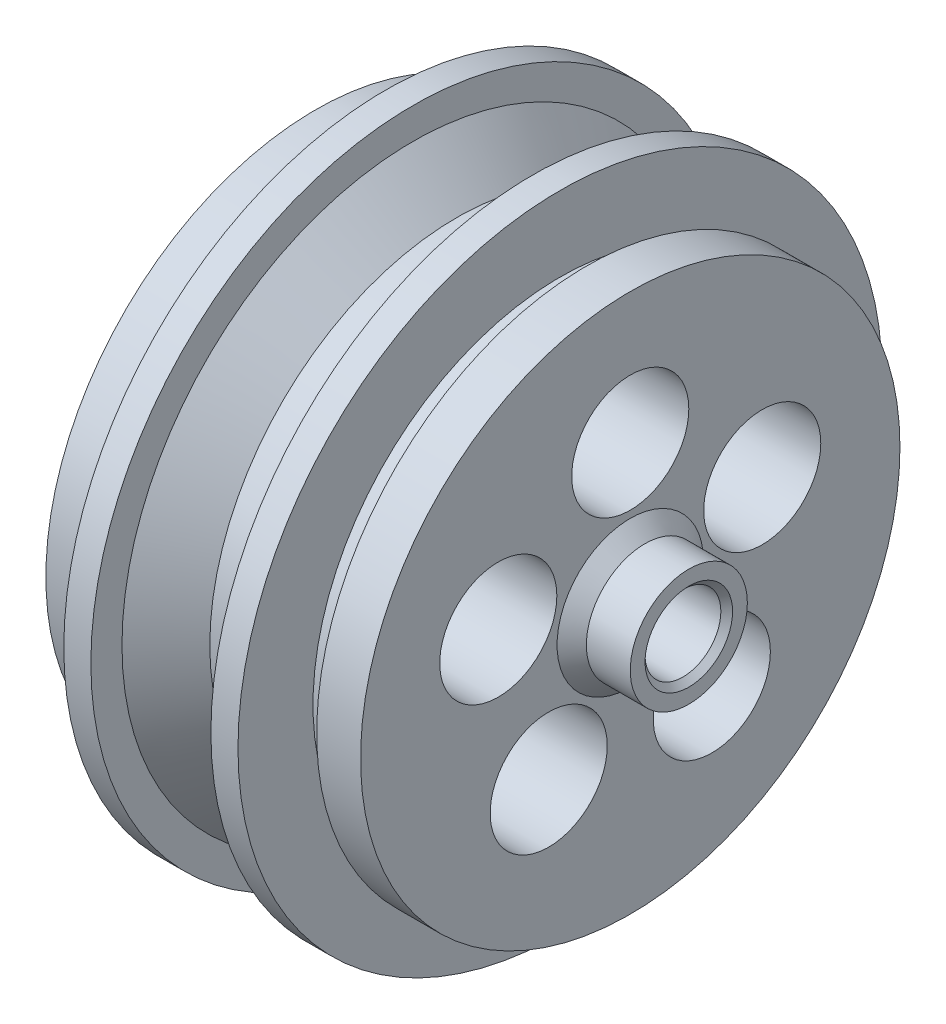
ISO-10303-21;
HEADER;
FILE_DESCRIPTION(('STEP AP214'),'2;1');
FILE_NAME('part.step','',(''),(''),'','','');
FILE_SCHEMA(('AUTOMOTIVE_DESIGN { 1 0 10303 214 1 1 1 1 }'));
ENDSEC;
DATA;
#1=APPLICATION_CONTEXT('core data for automotive mechanical design processes');
#2=APPLICATION_PROTOCOL_DEFINITION('international standard','automotive_design',2000,#1);
#3=PRODUCT_CONTEXT('',#1,'mechanical');
#4=PRODUCT('Part','Part','',(#3));
#5=PRODUCT_RELATED_PRODUCT_CATEGORY('part','',(#4));
#6=PRODUCT_DEFINITION_FORMATION('','',#4);
#7=PRODUCT_DEFINITION_CONTEXT('part definition',#1,'design');
#8=PRODUCT_DEFINITION('design','',#6,#7);
#9=PRODUCT_DEFINITION_SHAPE('','',#8);
#10=(LENGTH_UNIT() NAMED_UNIT(*) SI_UNIT(.MILLI.,.METRE.));
#11=(NAMED_UNIT(*) PLANE_ANGLE_UNIT() SI_UNIT($,.RADIAN.));
#12=(NAMED_UNIT(*) SI_UNIT($,.STERADIAN.) SOLID_ANGLE_UNIT());
#13=UNCERTAINTY_MEASURE_WITH_UNIT(LENGTH_MEASURE(1.E-05),#10,'distance_accuracy_value','');
#14=(GEOMETRIC_REPRESENTATION_CONTEXT(3) GLOBAL_UNCERTAINTY_ASSIGNED_CONTEXT((#13)) GLOBAL_UNIT_ASSIGNED_CONTEXT((#10,
#11,#12)) REPRESENTATION_CONTEXT('',''));
#15=CARTESIAN_POINT('',(0.,0.,0.));
#16=DIRECTION('',(0.,0.,1.));
#17=DIRECTION('',(1.,0.,0.));
#18=AXIS2_PLACEMENT_3D('',#15,#16,#17);
#19=CARTESIAN_POINT('',(14.85,0.,0.));
#20=DIRECTION('',(1.,0.,0.));
#21=DIRECTION('',(0.,0.,-1.));
#22=AXIS2_PLACEMENT_3D('',#19,#20,#21);
#23=PLANE('',#22);
#24=CARTESIAN_POINT('',(14.85,0.,0.));
#25=DIRECTION('',(1.,0.,0.));
#26=DIRECTION('',(0.,0.,-1.));
#27=AXIS2_PLACEMENT_3D('',#24,#25,#26);
#28=CIRCLE('',#27,5.);
#29=CARTESIAN_POINT('',(14.85,0.,-5.));
#30=VERTEX_POINT('',#29);
#31=EDGE_CURVE('E61',#30,#30,#28,.F.);
#32=ORIENTED_EDGE('',*,*,#31,.T.);
#33=EDGE_LOOP('',(#32));
#34=FACE_BOUND('',#33,.T.);
#35=CARTESIAN_POINT('',(14.85,0.,0.));
#36=DIRECTION('',(1.,0.,0.));
#37=DIRECTION('',(0.,0.,-1.));
#38=AXIS2_PLACEMENT_3D('',#35,#36,#37);
#39=CIRCLE('',#38,18.425);
#40=CARTESIAN_POINT('',(14.85,0.,-18.425));
#41=VERTEX_POINT('',#40);
#42=EDGE_CURVE('E103',#41,#41,#39,.T.);
#43=ORIENTED_EDGE('',*,*,#42,.T.);
#44=EDGE_LOOP('',(#43));
#45=FACE_BOUND('',#44,.T.);
#46=CARTESIAN_POINT('',(14.85,9.47983733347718,0.));
#47=DIRECTION('',(1.,0.,0.));
#48=DIRECTION('',(0.,0.,-1.));
#49=AXIS2_PLACEMENT_3D('',#46,#47,#48);
#50=CIRCLE('',#49,4.);
#51=CARTESIAN_POINT('',(14.85,9.47983733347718,-4.));
#52=VERTEX_POINT('',#51);
#53=EDGE_CURVE('E139',#52,#52,#50,.T.);
#54=ORIENTED_EDGE('',*,*,#53,.F.);
#55=EDGE_LOOP('',(#54));
#56=FACE_BOUND('',#55,.T.);
#57=CARTESIAN_POINT('',(14.85,2.92943083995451,-9.01586106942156));
#58=DIRECTION('',(1.,0.,0.));
#59=DIRECTION('',(0.,0.,-1.));
#60=AXIS2_PLACEMENT_3D('',#57,#58,#59);
#61=CIRCLE('',#60,4.);
#62=CARTESIAN_POINT('',(14.85,2.92943083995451,-13.0158610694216));
#63=VERTEX_POINT('',#62);
#64=EDGE_CURVE('E159',#63,#63,#61,.T.);
#65=ORIENTED_EDGE('',*,*,#64,.F.);
#66=EDGE_LOOP('',(#65));
#67=FACE_BOUND('',#66,.T.);
#68=CARTESIAN_POINT('',(14.85,-7.66934950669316,-5.57210857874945));
#69=DIRECTION('',(1.,0.,0.));
#70=DIRECTION('',(0.,0.,-1.));
#71=AXIS2_PLACEMENT_3D('',#68,#69,#70);
#72=CIRCLE('',#71,4.);
#73=CARTESIAN_POINT('',(14.85,-7.66934950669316,-9.57210857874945));
#74=VERTEX_POINT('',#73);
#75=EDGE_CURVE('E155',#74,#74,#72,.T.);
#76=ORIENTED_EDGE('',*,*,#75,.F.);
#77=EDGE_LOOP('',(#76));
#78=FACE_BOUND('',#77,.T.);
#79=CARTESIAN_POINT('',(14.85,-7.66934950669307,5.57210857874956));
#80=DIRECTION('',(1.,0.,0.));
#81=DIRECTION('',(0.,0.,-1.));
#82=AXIS2_PLACEMENT_3D('',#79,#80,#81);
#83=CIRCLE('',#82,4.);
#84=CARTESIAN_POINT('',(14.85,-7.66934950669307,1.57210857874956));
#85=VERTEX_POINT('',#84);
#86=EDGE_CURVE('E151',#85,#85,#83,.T.);
#87=ORIENTED_EDGE('',*,*,#86,.F.);
#88=EDGE_LOOP('',(#87));
#89=FACE_BOUND('',#88,.T.);
#90=CARTESIAN_POINT('',(14.85,2.92943083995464,9.01586106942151));
#91=DIRECTION('',(1.,0.,0.));
#92=DIRECTION('',(0.,0.,-1.));
#93=AXIS2_PLACEMENT_3D('',#90,#91,#92);
#94=CIRCLE('',#93,4.);
#95=CARTESIAN_POINT('',(14.85,2.92943083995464,5.01586106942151));
#96=VERTEX_POINT('',#95);
#97=EDGE_CURVE('E147',#96,#96,#94,.T.);
#98=ORIENTED_EDGE('',*,*,#97,.F.);
#99=EDGE_LOOP('',(#98));
#100=FACE_BOUND('',#99,.T.);
#101=ADVANCED_FACE('F45',(#34,#45,#56,#67,#78,#89,#100),#23,.T.);
#102=CARTESIAN_POINT('',(8.2,0.,0.));
#103=DIRECTION('',(-1.,0.,0.));
#104=DIRECTION('',(0.,0.,1.));
#105=AXIS2_PLACEMENT_3D('',#102,#103,#104);
#106=CYLINDRICAL_SURFACE('',#105,16.875);
#107=CARTESIAN_POINT('',(5.20000000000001,0.,0.));
#108=DIRECTION('',(1.,0.,0.));
#109=DIRECTION('',(0.,0.,-1.));
#110=AXIS2_PLACEMENT_3D('',#107,#108,#109);
#111=CIRCLE('',#110,16.875);
#112=CARTESIAN_POINT('',(5.20000000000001,0.,-16.875));
#113=VERTEX_POINT('',#112);
#114=EDGE_CURVE('E77',#113,#113,#111,.F.);
#115=ORIENTED_EDGE('',*,*,#114,.T.);
#116=EDGE_LOOP('',(#115));
#117=FACE_BOUND('',#116,.T.);
#118=CARTESIAN_POINT('',(3.00000000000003,0.,0.));
#119=DIRECTION('',(-1.,0.,0.));
#120=DIRECTION('',(0.,0.,1.));
#121=AXIS2_PLACEMENT_3D('',#118,#119,#120);
#122=CIRCLE('',#121,16.875);
#123=CARTESIAN_POINT('',(3.00000000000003,0.,16.875));
#124=VERTEX_POINT('',#123);
#125=EDGE_CURVE('E80',#124,#124,#122,.F.);
#126=ORIENTED_EDGE('',*,*,#125,.T.);
#127=EDGE_LOOP('',(#126));
#128=FACE_BOUND('',#127,.T.);
#129=ADVANCED_FACE('F198',(#117,#128),#106,.T.);
#130=CARTESIAN_POINT('',(10.05,0.,0.));
#131=DIRECTION('',(-1.,0.,0.));
#132=DIRECTION('',(0.,0.,1.));
#133=AXIS2_PLACEMENT_3D('',#130,#131,#132);
#134=CYLINDRICAL_SURFACE('',#133,22.);
#135=CARTESIAN_POINT('',(10.05,0.,0.));
#136=DIRECTION('',(1.,0.,0.));
#137=DIRECTION('',(0.,0.,-1.));
#138=AXIS2_PLACEMENT_3D('',#135,#136,#137);
#139=CIRCLE('',#138,22.);
#140=CARTESIAN_POINT('',(10.05,0.,-22.));
#141=VERTEX_POINT('',#140);
#142=EDGE_CURVE('E93',#141,#141,#139,.T.);
#143=ORIENTED_EDGE('',*,*,#142,.F.);
#144=EDGE_LOOP('',(#143));
#145=FACE_BOUND('',#144,.T.);
#146=CARTESIAN_POINT('',(8.2,0.,0.));
#147=DIRECTION('',(1.,0.,0.));
#148=DIRECTION('',(0.,0.,-1.));
#149=AXIS2_PLACEMENT_3D('',#146,#147,#148);
#150=CIRCLE('',#149,22.);
#151=CARTESIAN_POINT('',(8.2,0.,-22.));
#152=VERTEX_POINT('',#151);
#153=EDGE_CURVE('E89',#152,#152,#150,.T.);
#154=ORIENTED_EDGE('',*,*,#153,.T.);
#155=EDGE_LOOP('',(#154));
#156=FACE_BOUND('',#155,.T.);
#157=ADVANCED_FACE('F203',(#145,#156),#134,.T.);
#158=CARTESIAN_POINT('',(10.05,0.,0.));
#159=DIRECTION('',(1.,0.,0.));
#160=DIRECTION('',(0.,0.,-1.));
#161=AXIS2_PLACEMENT_3D('',#158,#159,#160);
#162=PLANE('',#161);
#163=CARTESIAN_POINT('',(10.05,0.,0.));
#164=DIRECTION('',(1.,0.,0.));
#165=DIRECTION('',(0.,0.,-1.));
#166=AXIS2_PLACEMENT_3D('',#163,#164,#165);
#167=CIRCLE('',#166,16.875);
#168=CARTESIAN_POINT('',(10.05,0.,-16.875));
#169=VERTEX_POINT('',#168);
#170=EDGE_CURVE('E88',#169,#169,#167,.T.);
#171=ORIENTED_EDGE('',*,*,#170,.F.);
#172=EDGE_LOOP('',(#171));
#173=FACE_BOUND('',#172,.T.);
#174=ORIENTED_EDGE('',*,*,#142,.T.);
#175=EDGE_LOOP('',(#174));
#176=FACE_BOUND('',#175,.T.);
#177=ADVANCED_FACE('F224',(#173,#176),#162,.T.);
#178=CARTESIAN_POINT('',(8.2,0.,0.));
#179=DIRECTION('',(1.,0.,0.));
#180=DIRECTION('',(0.,0.,-1.));
#181=AXIS2_PLACEMENT_3D('',#178,#179,#180);
#182=PLANE('',#181);
#183=CARTESIAN_POINT('',(8.2,0.,0.));
#184=DIRECTION('',(1.,0.,0.));
#185=DIRECTION('',(0.,0.,-1.));
#186=AXIS2_PLACEMENT_3D('',#183,#184,#185);
#187=CIRCLE('',#186,19.875);
#188=CARTESIAN_POINT('',(8.2,0.,-19.875));
#189=VERTEX_POINT('',#188);
#190=EDGE_CURVE('E84',#189,#189,#187,.T.);
#191=ORIENTED_EDGE('',*,*,#190,.T.);
#192=EDGE_LOOP('',(#191));
#193=FACE_BOUND('',#192,.T.);
#194=ORIENTED_EDGE('',*,*,#153,.F.);
#195=EDGE_LOOP('',(#194));
#196=FACE_BOUND('',#195,.T.);
#197=ADVANCED_FACE('F222',(#193,#196),#182,.F.);
#198=CARTESIAN_POINT('',(11.85,0.,0.));
#199=DIRECTION('',(-1.,0.,0.));
#200=DIRECTION('',(0.,0.,1.));
#201=AXIS2_PLACEMENT_3D('',#198,#199,#200);
#202=CYLINDRICAL_SURFACE('',#201,16.875);
#203=CARTESIAN_POINT('',(11.85,0.,0.));
#204=DIRECTION('',(1.,0.,0.));
#205=DIRECTION('',(0.,0.,-1.));
#206=AXIS2_PLACEMENT_3D('',#203,#204,#205);
#207=CIRCLE('',#206,16.875);
#208=CARTESIAN_POINT('',(11.85,0.,-16.875));
#209=VERTEX_POINT('',#208);
#210=EDGE_CURVE('E94',#209,#209,#207,.T.);
#211=ORIENTED_EDGE('',*,*,#210,.F.);
#212=EDGE_LOOP('',(#211));
#213=FACE_BOUND('',#212,.T.);
#214=ORIENTED_EDGE('',*,*,#170,.T.);
#215=EDGE_LOOP('',(#214));
#216=FACE_BOUND('',#215,.T.);
#217=ADVANCED_FACE('F218',(#213,#216),#202,.T.);
#218=CARTESIAN_POINT('',(14.85,0.,0.));
#219=DIRECTION('',(-1.,0.,0.));
#220=DIRECTION('',(0.,0.,1.));
#221=AXIS2_PLACEMENT_3D('',#218,#219,#220);
#222=CYLINDRICAL_SURFACE('',#221,18.425);
#223=ORIENTED_EDGE('',*,*,#42,.F.);
#224=EDGE_LOOP('',(#223));
#225=FACE_BOUND('',#224,.T.);
#226=CARTESIAN_POINT('',(11.85,0.,0.));
#227=DIRECTION('',(1.,0.,0.));
#228=DIRECTION('',(0.,0.,-1.));
#229=AXIS2_PLACEMENT_3D('',#226,#227,#228);
#230=CIRCLE('',#229,18.425);
#231=CARTESIAN_POINT('',(11.85,0.,-18.425));
#232=VERTEX_POINT('',#231);
#233=EDGE_CURVE('E104',#232,#232,#230,.T.);
#234=ORIENTED_EDGE('',*,*,#233,.T.);
#235=EDGE_LOOP('',(#234));
#236=FACE_BOUND('',#235,.T.);
#237=ADVANCED_FACE('F214',(#225,#236),#222,.T.);
#238=CARTESIAN_POINT('',(11.85,0.,0.));
#239=DIRECTION('',(1.,0.,0.));
#240=DIRECTION('',(0.,0.,-1.));
#241=AXIS2_PLACEMENT_3D('',#238,#239,#240);
#242=PLANE('',#241);
#243=ORIENTED_EDGE('',*,*,#210,.T.);
#244=EDGE_LOOP('',(#243));
#245=FACE_BOUND('',#244,.T.);
#246=ORIENTED_EDGE('',*,*,#233,.F.);
#247=EDGE_LOOP('',(#246));
#248=FACE_BOUND('',#247,.T.);
#249=ADVANCED_FACE('F211',(#245,#248),#242,.F.);
#250=CARTESIAN_POINT('',(-1.85,0.,0.));
#251=DIRECTION('',(1.,0.,0.));
#252=DIRECTION('',(0.,0.,-1.));
#253=AXIS2_PLACEMENT_3D('',#250,#251,#252);
#254=CYLINDRICAL_SURFACE('',#253,22.);
#255=CARTESIAN_POINT('',(-1.85,0.,0.));
#256=DIRECTION('',(1.,0.,0.));
#257=DIRECTION('',(0.,0.,-1.));
#258=AXIS2_PLACEMENT_3D('',#255,#256,#257);
#259=CIRCLE('',#258,22.);
#260=CARTESIAN_POINT('',(-1.85,0.,-22.));
#261=VERTEX_POINT('',#260);
#262=EDGE_CURVE('E108',#261,#261,#259,.T.);
#263=ORIENTED_EDGE('',*,*,#262,.T.);
#264=EDGE_LOOP('',(#263));
#265=FACE_BOUND('',#264,.T.);
#266=CARTESIAN_POINT('',(0.,0.,0.));
#267=DIRECTION('',(1.,0.,0.));
#268=DIRECTION('',(0.,0.,-1.));
#269=AXIS2_PLACEMENT_3D('',#266,#267,#268);
#270=CIRCLE('',#269,22.);
#271=CARTESIAN_POINT('',(0.,0.,-22.));
#272=VERTEX_POINT('',#271);
#273=EDGE_CURVE('E112',#272,#272,#270,.T.);
#274=ORIENTED_EDGE('',*,*,#273,.F.);
#275=EDGE_LOOP('',(#274));
#276=FACE_BOUND('',#275,.T.);
#277=ADVANCED_FACE('F209',(#265,#276),#254,.T.);
#278=CARTESIAN_POINT('',(-1.85,0.,0.));
#279=DIRECTION('',(-1.,0.,0.));
#280=DIRECTION('',(0.,0.,-1.));
#281=AXIS2_PLACEMENT_3D('',#278,#279,#280);
#282=PLANE('',#281);
#283=CARTESIAN_POINT('',(-1.85,0.,0.));
#284=DIRECTION('',(1.,0.,0.));
#285=DIRECTION('',(0.,0.,-1.));
#286=AXIS2_PLACEMENT_3D('',#283,#284,#285);
#287=CIRCLE('',#286,16.875);
#288=CARTESIAN_POINT('',(-1.85,0.,-16.875));
#289=VERTEX_POINT('',#288);
#290=EDGE_CURVE('E116',#289,#289,#287,.T.);
#291=ORIENTED_EDGE('',*,*,#290,.T.);
#292=EDGE_LOOP('',(#291));
#293=FACE_BOUND('',#292,.T.);
#294=ORIENTED_EDGE('',*,*,#262,.F.);
#295=EDGE_LOOP('',(#294));
#296=FACE_BOUND('',#295,.T.);
#297=ADVANCED_FACE('F262',(#293,#296),#282,.T.);
#298=CARTESIAN_POINT('',(0.,0.,0.));
#299=DIRECTION('',(-1.,0.,0.));
#300=DIRECTION('',(0.,0.,-1.));
#301=AXIS2_PLACEMENT_3D('',#298,#299,#300);
#302=PLANE('',#301);
#303=CARTESIAN_POINT('',(0.,0.,0.));
#304=DIRECTION('',(-1.,0.,0.));
#305=DIRECTION('',(0.,0.,1.));
#306=AXIS2_PLACEMENT_3D('',#303,#304,#305);
#307=CIRCLE('',#306,19.875);
#308=CARTESIAN_POINT('',(0.,0.,19.875));
#309=VERTEX_POINT('',#308);
#310=EDGE_CURVE('E73',#309,#309,#307,.T.);
#311=ORIENTED_EDGE('',*,*,#310,.T.);
#312=EDGE_LOOP('',(#311));
#313=FACE_BOUND('',#312,.T.);
#314=ORIENTED_EDGE('',*,*,#273,.T.);
#315=EDGE_LOOP('',(#314));
#316=FACE_BOUND('',#315,.T.);
#317=ADVANCED_FACE('F258',(#313,#316),#302,.F.);
#318=CARTESIAN_POINT('',(-3.65,0.,0.));
#319=DIRECTION('',(1.,0.,0.));
#320=DIRECTION('',(0.,0.,-1.));
#321=AXIS2_PLACEMENT_3D('',#318,#319,#320);
#322=CYLINDRICAL_SURFACE('',#321,16.875);
#323=CARTESIAN_POINT('',(-3.65,0.,0.));
#324=DIRECTION('',(1.,0.,0.));
#325=DIRECTION('',(0.,0.,-1.));
#326=AXIS2_PLACEMENT_3D('',#323,#324,#325);
#327=CIRCLE('',#326,16.875);
#328=CARTESIAN_POINT('',(-3.65,0.,-16.875));
#329=VERTEX_POINT('',#328);
#330=EDGE_CURVE('E123',#329,#329,#327,.T.);
#331=ORIENTED_EDGE('',*,*,#330,.T.);
#332=EDGE_LOOP('',(#331));
#333=FACE_BOUND('',#332,.T.);
#334=ORIENTED_EDGE('',*,*,#290,.F.);
#335=EDGE_LOOP('',(#334));
#336=FACE_BOUND('',#335,.T.);
#337=ADVANCED_FACE('F261',(#333,#336),#322,.T.);
#338=CARTESIAN_POINT('',(-6.65,0.,0.));
#339=DIRECTION('',(1.,0.,0.));
#340=DIRECTION('',(0.,0.,-1.));
#341=AXIS2_PLACEMENT_3D('',#338,#339,#340);
#342=CYLINDRICAL_SURFACE('',#341,18.425);
#343=CARTESIAN_POINT('',(-6.65,0.,0.));
#344=DIRECTION('',(1.,0.,0.));
#345=DIRECTION('',(0.,0.,-1.));
#346=AXIS2_PLACEMENT_3D('',#343,#344,#345);
#347=CIRCLE('',#346,18.425);
#348=CARTESIAN_POINT('',(-6.65,0.,-18.425));
#349=VERTEX_POINT('',#348);
#350=EDGE_CURVE('E127',#349,#349,#347,.T.);
#351=ORIENTED_EDGE('',*,*,#350,.T.);
#352=EDGE_LOOP('',(#351));
#353=FACE_BOUND('',#352,.T.);
#354=CARTESIAN_POINT('',(-3.65,0.,0.));
#355=DIRECTION('',(1.,0.,0.));
#356=DIRECTION('',(0.,0.,-1.));
#357=AXIS2_PLACEMENT_3D('',#354,#355,#356);
#358=CIRCLE('',#357,18.425);
#359=CARTESIAN_POINT('',(-3.65,0.,-18.425));
#360=VERTEX_POINT('',#359);
#361=EDGE_CURVE('E128',#360,#360,#358,.T.);
#362=ORIENTED_EDGE('',*,*,#361,.F.);
#363=EDGE_LOOP('',(#362));
#364=FACE_BOUND('',#363,.T.);
#365=ADVANCED_FACE('F277',(#353,#364),#342,.T.);
#366=CARTESIAN_POINT('',(-6.65,0.,0.));
#367=DIRECTION('',(-1.,0.,0.));
#368=DIRECTION('',(0.,0.,-1.));
#369=AXIS2_PLACEMENT_3D('',#366,#367,#368);
#370=PLANE('',#369);
#371=CARTESIAN_POINT('',(-6.65,2.92943083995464,9.01586106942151));
#372=DIRECTION('',(1.,0.,0.));
#373=DIRECTION('',(0.,0.95105651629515,-0.309016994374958));
#374=AXIS2_PLACEMENT_3D('',#371,#372,#373);
#375=CIRCLE('',#374,4.);
#376=CARTESIAN_POINT('',(-6.65,6.73365690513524,7.77979309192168));
#377=VERTEX_POINT('',#376);
#378=EDGE_CURVE('E168',#377,#377,#375,.T.);
#379=ORIENTED_EDGE('',*,*,#378,.T.);
#380=EDGE_LOOP('',(#379));
#381=FACE_BOUND('',#380,.T.);
#382=CARTESIAN_POINT('',(-6.65,-7.66934950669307,5.57210857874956));
#383=DIRECTION('',(1.,0.,0.));
#384=DIRECTION('',(0.,0.58778525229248,0.809016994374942));
#385=AXIS2_PLACEMENT_3D('',#382,#383,#384);
#386=CIRCLE('',#385,4.);
#387=CARTESIAN_POINT('',(-6.65,-5.31820849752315,8.80817655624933));
#388=VERTEX_POINT('',#387);
#389=EDGE_CURVE('E171',#388,#388,#386,.T.);
#390=ORIENTED_EDGE('',*,*,#389,.T.);
#391=EDGE_LOOP('',(#390));
#392=FACE_BOUND('',#391,.T.);
#393=CARTESIAN_POINT('',(-6.65,-7.66934950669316,-5.57210857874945));
#394=DIRECTION('',(1.,0.,0.));
#395=DIRECTION('',(0.,-0.587785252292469,0.809016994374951));
#396=AXIS2_PLACEMENT_3D('',#393,#394,#395);
#397=CIRCLE('',#396,4.);
#398=CARTESIAN_POINT('',(-6.65,-10.020490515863,-2.33604060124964));
#399=VERTEX_POINT('',#398);
#400=EDGE_CURVE('E167',#399,#399,#397,.T.);
#401=ORIENTED_EDGE('',*,*,#400,.T.);
#402=EDGE_LOOP('',(#401));
#403=FACE_BOUND('',#402,.T.);
#404=CARTESIAN_POINT('',(-6.65,2.92943083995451,-9.01586106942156));
#405=DIRECTION('',(1.,0.,0.));
#406=DIRECTION('',(0.,-0.951056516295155,-0.309016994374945));
#407=AXIS2_PLACEMENT_3D('',#404,#405,#406);
#408=CIRCLE('',#407,4.);
#409=CARTESIAN_POINT('',(-6.65,-0.874795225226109,-10.2519290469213));
#410=VERTEX_POINT('',#409);
#411=EDGE_CURVE('E163',#410,#410,#408,.T.);
#412=ORIENTED_EDGE('',*,*,#411,.T.);
#413=EDGE_LOOP('',(#412));
#414=FACE_BOUND('',#413,.T.);
#415=CARTESIAN_POINT('',(-6.65,9.47983733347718,0.));
#416=DIRECTION('',(1.,0.,0.));
#417=DIRECTION('',(0.,0.,-1.));
#418=AXIS2_PLACEMENT_3D('',#415,#416,#417);
#419=CIRCLE('',#418,4.);
#420=CARTESIAN_POINT('',(-6.65,9.47983733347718,-4.));
#421=VERTEX_POINT('',#420);
#422=EDGE_CURVE('E143',#421,#421,#419,.T.);
#423=ORIENTED_EDGE('',*,*,#422,.T.);
#424=EDGE_LOOP('',(#423));
#425=FACE_BOUND('',#424,.T.);
#426=CARTESIAN_POINT('',(-6.65,0.,0.));
#427=DIRECTION('',(1.,0.,0.));
#428=DIRECTION('',(0.,0.,-1.));
#429=AXIS2_PLACEMENT_3D('',#426,#427,#428);
#430=CIRCLE('',#429,2.59);
#431=CARTESIAN_POINT('',(-6.65,0.,-2.59));
#432=VERTEX_POINT('',#431);
#433=EDGE_CURVE('E132',#432,#432,#430,.T.);
#434=ORIENTED_EDGE('',*,*,#433,.T.);
#435=EDGE_LOOP('',(#434));
#436=FACE_BOUND('',#435,.T.);
#437=ORIENTED_EDGE('',*,*,#350,.F.);
#438=EDGE_LOOP('',(#437));
#439=FACE_BOUND('',#438,.T.);
#440=ADVANCED_FACE('F281',(#381,#392,#403,#414,#425,#436,#439),#370,.T.);
#441=CARTESIAN_POINT('',(-3.65,0.,0.));
#442=DIRECTION('',(-1.,0.,0.));
#443=DIRECTION('',(0.,0.,-1.));
#444=AXIS2_PLACEMENT_3D('',#441,#442,#443);
#445=PLANE('',#444);
#446=ORIENTED_EDGE('',*,*,#330,.F.);
#447=EDGE_LOOP('',(#446));
#448=FACE_BOUND('',#447,.T.);
#449=ORIENTED_EDGE('',*,*,#361,.T.);
#450=EDGE_LOOP('',(#449));
#451=FACE_BOUND('',#450,.T.);
#452=ADVANCED_FACE('F283',(#448,#451),#445,.F.);
#453=CARTESIAN_POINT('',(-6.65,0.,0.));
#454=DIRECTION('',(1.,0.,0.));
#455=DIRECTION('',(0.,0.,-1.));
#456=AXIS2_PLACEMENT_3D('',#453,#454,#455);
#457=CYLINDRICAL_SURFACE('',#456,2.59);
#458=CARTESIAN_POINT('',(18.45,0.,0.));
#459=DIRECTION('',(1.,0.,0.));
#460=DIRECTION('',(0.,0.,-1.));
#461=AXIS2_PLACEMENT_3D('',#458,#459,#460);
#462=CIRCLE('',#461,2.59);
#463=CARTESIAN_POINT('',(18.45,0.,-2.59));
#464=VERTEX_POINT('',#463);
#465=EDGE_CURVE('E54',#464,#464,#462,.T.);
#466=ORIENTED_EDGE('',*,*,#465,.T.);
#467=EDGE_LOOP('',(#466));
#468=FACE_BOUND('',#467,.T.);
#469=ORIENTED_EDGE('',*,*,#433,.F.);
#470=EDGE_LOOP('',(#469));
#471=FACE_BOUND('',#470,.T.);
#472=ADVANCED_FACE('F286',(#468,#471),#457,.F.);
#473=CARTESIAN_POINT('',(-6.65,9.47983733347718,0.));
#474=DIRECTION('',(1.,0.,0.));
#475=DIRECTION('',(0.,0.,-1.));
#476=AXIS2_PLACEMENT_3D('',#473,#474,#475);
#477=CYLINDRICAL_SURFACE('',#476,4.);
#478=ORIENTED_EDGE('',*,*,#53,.T.);
#479=EDGE_LOOP('',(#478));
#480=FACE_BOUND('',#479,.T.);
#481=ORIENTED_EDGE('',*,*,#422,.F.);
#482=EDGE_LOOP('',(#481));
#483=FACE_BOUND('',#482,.T.);
#484=ADVANCED_FACE('F293',(#480,#483),#477,.F.);
#485=CARTESIAN_POINT('',(-6.65,2.92943083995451,-9.01586106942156));
#486=DIRECTION('',(1.,0.,0.));
#487=DIRECTION('',(0.,0.,-1.));
#488=AXIS2_PLACEMENT_3D('',#485,#486,#487);
#489=CYLINDRICAL_SURFACE('',#488,4.);
#490=ORIENTED_EDGE('',*,*,#64,.T.);
#491=EDGE_LOOP('',(#490));
#492=FACE_BOUND('',#491,.T.);
#493=ORIENTED_EDGE('',*,*,#411,.F.);
#494=EDGE_LOOP('',(#493));
#495=FACE_BOUND('',#494,.T.);
#496=ADVANCED_FACE('F296',(#492,#495),#489,.F.);
#497=CARTESIAN_POINT('',(-6.65,-7.66934950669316,-5.57210857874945));
#498=DIRECTION('',(1.,0.,0.));
#499=DIRECTION('',(0.,0.,-1.));
#500=AXIS2_PLACEMENT_3D('',#497,#498,#499);
#501=CYLINDRICAL_SURFACE('',#500,4.);
#502=ORIENTED_EDGE('',*,*,#75,.T.);
#503=EDGE_LOOP('',(#502));
#504=FACE_BOUND('',#503,.T.);
#505=ORIENTED_EDGE('',*,*,#400,.F.);
#506=EDGE_LOOP('',(#505));
#507=FACE_BOUND('',#506,.T.);
#508=ADVANCED_FACE('F300',(#504,#507),#501,.F.);
#509=CARTESIAN_POINT('',(-6.65,-7.66934950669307,5.57210857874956));
#510=DIRECTION('',(1.,0.,0.));
#511=DIRECTION('',(0.,0.,-1.));
#512=AXIS2_PLACEMENT_3D('',#509,#510,#511);
#513=CYLINDRICAL_SURFACE('',#512,4.);
#514=ORIENTED_EDGE('',*,*,#86,.T.);
#515=EDGE_LOOP('',(#514));
#516=FACE_BOUND('',#515,.T.);
#517=ORIENTED_EDGE('',*,*,#389,.F.);
#518=EDGE_LOOP('',(#517));
#519=FACE_BOUND('',#518,.T.);
#520=ADVANCED_FACE('F304',(#516,#519),#513,.F.);
#521=CARTESIAN_POINT('',(-6.65,2.92943083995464,9.01586106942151));
#522=DIRECTION('',(1.,0.,0.));
#523=DIRECTION('',(0.,0.,-1.));
#524=AXIS2_PLACEMENT_3D('',#521,#522,#523);
#525=CYLINDRICAL_SURFACE('',#524,4.);
#526=ORIENTED_EDGE('',*,*,#97,.T.);
#527=EDGE_LOOP('',(#526));
#528=FACE_BOUND('',#527,.T.);
#529=ORIENTED_EDGE('',*,*,#378,.F.);
#530=EDGE_LOOP('',(#529));
#531=FACE_BOUND('',#530,.T.);
#532=ADVANCED_FACE('F241',(#528,#531),#525,.F.);
#533=CARTESIAN_POINT('',(8.2,0.,0.));
#534=DIRECTION('',(1.,0.,0.));
#535=DIRECTION('',(0.,0.,-1.));
#536=AXIS2_PLACEMENT_3D('',#533,#534,#535);
#537=CONICAL_SURFACE('',#536,19.875,0.785398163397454);
#538=ORIENTED_EDGE('',*,*,#114,.F.);
#539=EDGE_LOOP('',(#538));
#540=FACE_BOUND('',#539,.T.);
#541=ORIENTED_EDGE('',*,*,#190,.F.);
#542=EDGE_LOOP('',(#541));
#543=FACE_BOUND('',#542,.T.);
#544=ADVANCED_FACE('F235',(#540,#543),#537,.T.);
#545=CARTESIAN_POINT('',(3.00000000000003,0.,0.));
#546=DIRECTION('',(-1.,0.,0.));
#547=DIRECTION('',(0.,0.,1.));
#548=AXIS2_PLACEMENT_3D('',#545,#546,#547);
#549=CONICAL_SURFACE('',#548,16.875,0.785398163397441);
#550=ORIENTED_EDGE('',*,*,#310,.F.);
#551=EDGE_LOOP('',(#550));
#552=FACE_BOUND('',#551,.T.);
#553=ORIENTED_EDGE('',*,*,#125,.F.);
#554=EDGE_LOOP('',(#553));
#555=FACE_BOUND('',#554,.T.);
#556=ADVANCED_FACE('F194',(#552,#555),#549,.T.);
#557=CARTESIAN_POINT('',(18.85,0.,0.));
#558=DIRECTION('',(1.,0.,0.));
#559=DIRECTION('',(0.,0.,-1.));
#560=AXIS2_PLACEMENT_3D('',#557,#558,#559);
#561=PLANE('',#560);
#562=CARTESIAN_POINT('',(18.85,0.,0.));
#563=DIRECTION('',(1.,0.,0.));
#564=DIRECTION('',(0.,0.,-1.));
#565=AXIS2_PLACEMENT_3D('',#562,#563,#564);
#566=CIRCLE('',#565,2.99000000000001);
#567=CARTESIAN_POINT('',(18.85,0.,-2.99000000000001));
#568=VERTEX_POINT('',#567);
#569=EDGE_CURVE('E10',#568,#568,#566,.F.);
#570=ORIENTED_EDGE('',*,*,#569,.T.);
#571=EDGE_LOOP('',(#570));
#572=FACE_BOUND('',#571,.T.);
#573=CARTESIAN_POINT('',(18.85,0.,0.));
#574=DIRECTION('',(1.,0.,0.));
#575=DIRECTION('',(0.,0.,-1.));
#576=AXIS2_PLACEMENT_3D('',#573,#574,#575);
#577=CIRCLE('',#576,4.);
#578=CARTESIAN_POINT('',(18.85,0.,-4.));
#579=VERTEX_POINT('',#578);
#580=EDGE_CURVE('E172',#579,#579,#577,.T.);
#581=ORIENTED_EDGE('',*,*,#580,.T.);
#582=EDGE_LOOP('',(#581));
#583=FACE_BOUND('',#582,.T.);
#584=ADVANCED_FACE('F183',(#572,#583),#561,.T.);
#585=CARTESIAN_POINT('',(18.85,0.,0.));
#586=DIRECTION('',(-1.,0.,0.));
#587=DIRECTION('',(0.,0.,1.));
#588=AXIS2_PLACEMENT_3D('',#585,#586,#587);
#589=CYLINDRICAL_SURFACE('',#588,4.);
#590=CARTESIAN_POINT('',(15.85,0.,0.));
#591=DIRECTION('',(1.,0.,0.));
#592=DIRECTION('',(0.,0.,-1.));
#593=AXIS2_PLACEMENT_3D('',#590,#591,#592);
#594=CIRCLE('',#593,4.);
#595=CARTESIAN_POINT('',(15.85,0.,-4.));
#596=VERTEX_POINT('',#595);
#597=EDGE_CURVE('E67',#596,#596,#594,.T.);
#598=ORIENTED_EDGE('',*,*,#597,.T.);
#599=EDGE_LOOP('',(#598));
#600=FACE_BOUND('',#599,.T.);
#601=ORIENTED_EDGE('',*,*,#580,.F.);
#602=EDGE_LOOP('',(#601));
#603=FACE_BOUND('',#602,.T.);
#604=ADVANCED_FACE('F185',(#600,#603),#589,.T.);
#605=CARTESIAN_POINT('',(15.85,0.,0.));
#606=DIRECTION('',(-1.,0.,0.));
#607=DIRECTION('',(0.,0.,1.));
#608=AXIS2_PLACEMENT_3D('',#605,#606,#607);
#609=CONICAL_SURFACE('',#608,4.,0.785398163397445);
#610=ORIENTED_EDGE('',*,*,#31,.F.);
#611=EDGE_LOOP('',(#610));
#612=FACE_BOUND('',#611,.T.);
#613=ORIENTED_EDGE('',*,*,#597,.F.);
#614=EDGE_LOOP('',(#613));
#615=FACE_BOUND('',#614,.T.);
#616=ADVANCED_FACE('F187',(#612,#615),#609,.T.);
#617=CARTESIAN_POINT('',(18.45,0.,0.));
#618=DIRECTION('',(1.,0.,0.));
#619=DIRECTION('',(0.,0.,-1.));
#620=AXIS2_PLACEMENT_3D('',#617,#618,#619);
#621=CONICAL_SURFACE('',#620,2.59,0.78539816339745);
#622=ORIENTED_EDGE('',*,*,#569,.F.);
#623=EDGE_LOOP('',(#622));
#624=FACE_BOUND('',#623,.T.);
#625=ORIENTED_EDGE('',*,*,#465,.F.);
#626=EDGE_LOOP('',(#625));
#627=FACE_BOUND('',#626,.T.);
#628=ADVANCED_FACE('F48',(#624,#627),#621,.F.);
#629=CLOSED_SHELL('',(#101,#129,#157,#177,#197,#217,#237,#249,#277,#297,#317,#337,#365,#440,
#452,#472,#484,#496,#508,#520,#532,#544,#556,#584,#604,#616,#628));
#630=MANIFOLD_SOLID_BREP('B2',#629);
#631=ADVANCED_BREP_SHAPE_REPRESENTATION('',(#18,#630),#14);
#632=SHAPE_DEFINITION_REPRESENTATION(#9,#631);
ENDSEC;
END-ISO-10303-21;
